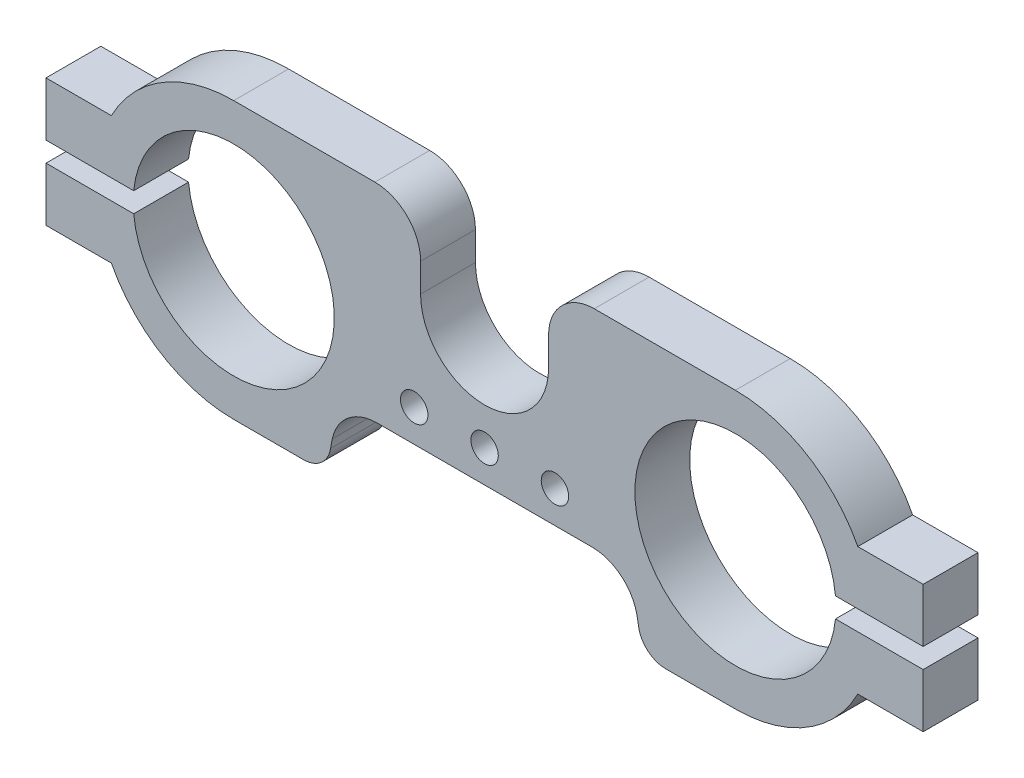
from build123d import *

# Parameters (mm, degrees)
SKETCH1_R           = 1.5
BOSS_EXTRUDE1_DEPTH = 6


with BuildPart() as part:
    # Sketch1 → Boss-Extrude1 (new body)
    with BuildSketch(Plane.XY):
        with BuildLine():
            Line((-199.902156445, 7.667079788), (-207.532001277, 7.667079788))
            ThreePointArc((-207.532001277, 7.667079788), (-209.488072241, 8.392483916), (-210.498181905, 10.217888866))
            ThreePointArc((-210.498181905, 10.217888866), (-210.581443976, 10.717427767), (-210.679517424, 11.214271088))
            ThreePointArc((-210.679517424, 11.214271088), (-212.423935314, 14.059406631), (-215.569930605, 15.173185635))
            Line((-215.569930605, 15.173185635), (-239.114382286, 15.173185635))
            ThreePointArc((-239.114382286, 15.173185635), (-242.260377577, 14.059406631), (-244.004795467, 11.214271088))
            ThreePointArc((-244.004795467, 11.214271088), (-244.102868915, 10.717427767), (-244.186130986, 10.217888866))
            ThreePointArc((-244.186130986, 10.217888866), (-245.19624065, 8.392483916), (-247.152311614, 7.667079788))
            Line((-247.152311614, 7.667079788), (-254.782156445, 7.667079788))
            ThreePointArc((-254.782156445, 7.667079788), (-262.611295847, 9.85471364), (-268.172421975, 15.78388237))
            Line((-268.172421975, 15.78388237), (-275.32063765, 15.78388237))
            Line((-275.32063765, 15.78388237), (-275.32063765, 18.463958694))
            Line((-275.32063765, 18.463958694), (-275.32063765, 21.680050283))
            Line((-275.32063765, 21.680050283), (-265.727981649, 21.680050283))
            ThreePointArc((-265.727981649, 21.680050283), (-243.782156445, 22.770422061), (-265.727981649, 23.860793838))
            Line((-265.727981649, 23.860793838), (-275.32063765, 23.860793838))
            Line((-275.32063765, 23.860793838), (-275.32063765, 27.076885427))
            Line((-275.32063765, 27.076885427), (-275.32063765, 29.756961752))
            Line((-275.32063765, 29.756961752), (-268.172421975, 29.756961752))
            ThreePointArc((-268.172421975, 29.756961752), (-262.611295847, 35.686130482), (-254.782156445, 37.873764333))
            Line((-254.782156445, 37.873764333), (-239.342156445, 37.873764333))
            ThreePointArc((-239.342156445, 37.873764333), (-235.80662254, 36.409298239), (-234.342156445, 32.873764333))
            Line((-234.342156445, 32.873764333), (-234.342156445, 29.756961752))
            ThreePointArc((-234.342156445, 29.756961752), (-227.342156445, 22.756961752), (-220.342156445, 29.756961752))
            Line((-220.342156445, 29.756961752), (-220.342156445, 32.873764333))
            ThreePointArc((-220.342156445, 32.873764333), (-218.877690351, 36.409298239), (-215.342156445, 37.873764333))
            Line((-215.342156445, 37.873764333), (-199.902156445, 37.873764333))
            ThreePointArc((-199.902156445, 37.873764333), (-192.073017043, 35.686130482), (-186.511890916, 29.756961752))
            Line((-186.511890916, 29.756961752), (-179.363675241, 29.756961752))
            Line((-179.363675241, 29.756961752), (-179.363675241, 27.076885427))
            Line((-179.363675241, 27.076885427), (-179.363675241, 23.860793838))
            Line((-179.363675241, 23.860793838), (-188.956331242, 23.860793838))
            ThreePointArc((-188.956331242, 23.860793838), (-210.902156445, 22.770422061), (-188.956331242, 21.680050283))
            Line((-188.956331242, 21.680050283), (-179.363675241, 21.680050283))
            Line((-179.363675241, 21.680050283), (-179.363675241, 18.463958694))
            Line((-179.363675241, 18.463958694), (-179.363675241, 15.78388237))
            Line((-179.363675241, 15.78388237), (-186.511890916, 15.78388237))
            ThreePointArc((-186.511890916, 15.78388237), (-192.073017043, 9.85471364), (-199.902156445, 7.667079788))
        make_face()
        with Locations((-235.040096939, 18.698580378)):
            Circle(SKETCH1_R, mode=Mode.SUBTRACT)
        with Locations(Location((-219.644215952, 18.698580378, 0), (0, 0, 180))):
            Circle(SKETCH1_R, mode=Mode.SUBTRACT)
        with Locations((-227.342156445, 18.698580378)):
            Circle(SKETCH1_R, mode=Mode.SUBTRACT)
    extrude(amount=BOSS_EXTRUDE1_DEPTH)


solid = part.part
